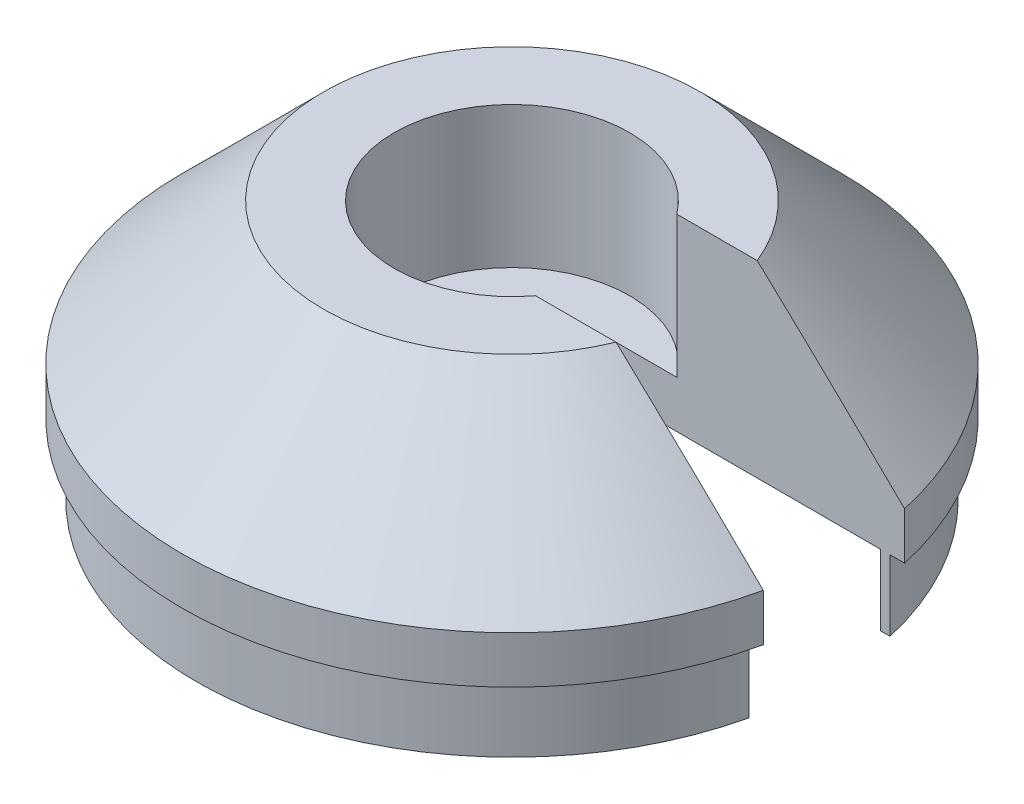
ISO-10303-21;
HEADER;
FILE_DESCRIPTION(('STEP AP214'),'2;1');
FILE_NAME('part.step','',(''),(''),'','','');
FILE_SCHEMA(('AUTOMOTIVE_DESIGN { 1 0 10303 214 1 1 1 1 }'));
ENDSEC;
DATA;
#1=APPLICATION_CONTEXT('core data for automotive mechanical design processes');
#2=APPLICATION_PROTOCOL_DEFINITION('international standard','automotive_design',2000,#1);
#3=PRODUCT_CONTEXT('',#1,'mechanical');
#4=PRODUCT('Part','Part','',(#3));
#5=PRODUCT_RELATED_PRODUCT_CATEGORY('part','',(#4));
#6=PRODUCT_DEFINITION_FORMATION('','',#4);
#7=PRODUCT_DEFINITION_CONTEXT('part definition',#1,'design');
#8=PRODUCT_DEFINITION('design','',#6,#7);
#9=PRODUCT_DEFINITION_SHAPE('','',#8);
#10=(LENGTH_UNIT() NAMED_UNIT(*) SI_UNIT(.MILLI.,.METRE.));
#11=(NAMED_UNIT(*) PLANE_ANGLE_UNIT() SI_UNIT($,.RADIAN.));
#12=(NAMED_UNIT(*) SI_UNIT($,.STERADIAN.) SOLID_ANGLE_UNIT());
#13=UNCERTAINTY_MEASURE_WITH_UNIT(LENGTH_MEASURE(1.E-05),#10,'distance_accuracy_value','');
#14=(GEOMETRIC_REPRESENTATION_CONTEXT(3) GLOBAL_UNCERTAINTY_ASSIGNED_CONTEXT((#13)) GLOBAL_UNIT_ASSIGNED_CONTEXT((#10,
#11,#12)) REPRESENTATION_CONTEXT('',''));
#15=CARTESIAN_POINT('',(0.,0.,0.));
#16=DIRECTION('',(0.,0.,1.));
#17=DIRECTION('',(1.,0.,0.));
#18=AXIS2_PLACEMENT_3D('',#15,#16,#17);
#19=CARTESIAN_POINT('',(6.5,0.,0.));
#20=DIRECTION('',(0.,-1.,0.));
#21=DIRECTION('',(0.,0.,-1.));
#22=AXIS2_PLACEMENT_3D('',#19,#20,#21);
#23=PLANE('',#22);
#24=CARTESIAN_POINT('',(0.,0.,0.));
#25=DIRECTION('',(0.,-1.,0.));
#26=DIRECTION('',(0.,0.,-1.));
#27=AXIS2_PLACEMENT_3D('',#24,#25,#26);
#28=CIRCLE('',#27,1.5);
#29=CARTESIAN_POINT('',(0.,0.,1.5));
#30=VERTEX_POINT('',#29);
#31=CARTESIAN_POINT('',(0.,0.,-1.5));
#32=VERTEX_POINT('',#31);
#33=EDGE_CURVE('E158',#30,#32,#28,.T.);
#34=ORIENTED_EDGE('',*,*,#33,.F.);
#35=DIRECTION('',(1.,0.,0.));
#36=VECTOR('',#35,1.);
#37=CARTESIAN_POINT('',(6.5,0.,1.5));
#38=LINE('',#37,#36);
#39=CARTESIAN_POINT('',(6.32455532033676,0.,1.5));
#40=VERTEX_POINT('',#39);
#41=EDGE_CURVE('E167',#30,#40,#38,.T.);
#42=ORIENTED_EDGE('',*,*,#41,.T.);
#43=CARTESIAN_POINT('',(0.,0.,0.));
#44=DIRECTION('',(0.,-1.,0.));
#45=DIRECTION('',(0.,0.,-1.));
#46=AXIS2_PLACEMENT_3D('',#43,#44,#45);
#47=CIRCLE('',#46,6.5);
#48=CARTESIAN_POINT('',(6.32455532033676,0.,-1.5));
#49=VERTEX_POINT('',#48);
#50=EDGE_CURVE('E137',#40,#49,#47,.T.);
#51=ORIENTED_EDGE('',*,*,#50,.T.);
#52=DIRECTION('',(-1.,0.,0.));
#53=VECTOR('',#52,1.);
#54=CARTESIAN_POINT('',(6.5,0.,-1.5));
#55=LINE('',#54,#53);
#56=EDGE_CURVE('E46',#49,#32,#55,.T.);
#57=ORIENTED_EDGE('',*,*,#56,.T.);
#58=EDGE_LOOP('',(#34,#42,#51,#57));
#59=FACE_BOUND('',#58,.T.);
#60=ADVANCED_FACE('F32',(#59),#23,.T.);
#61=CARTESIAN_POINT('',(0.,0.,0.));
#62=DIRECTION('',(0.,-1.,0.));
#63=DIRECTION('',(0.,0.,-1.));
#64=AXIS2_PLACEMENT_3D('',#61,#62,#63);
#65=CYLINDRICAL_SURFACE('',#64,1.5);
#66=CARTESIAN_POINT('',(0.,0.999999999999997,0.));
#67=DIRECTION('',(0.,-1.,0.));
#68=DIRECTION('',(0.,0.,-1.));
#69=AXIS2_PLACEMENT_3D('',#66,#67,#68);
#70=CIRCLE('',#69,1.5);
#71=CARTESIAN_POINT('',(0.,0.999999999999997,1.5));
#72=VERTEX_POINT('',#71);
#73=CARTESIAN_POINT('',(0.,0.999999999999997,-1.5));
#74=VERTEX_POINT('',#73);
#75=EDGE_CURVE('E155',#72,#74,#70,.T.);
#76=ORIENTED_EDGE('',*,*,#75,.F.);
#77=DIRECTION('',(0.,-1.,0.));
#78=VECTOR('',#77,1.);
#79=CARTESIAN_POINT('',(0.,4.,1.5));
#80=LINE('',#79,#78);
#81=EDGE_CURVE('E264',#72,#30,#80,.T.);
#82=ORIENTED_EDGE('',*,*,#81,.T.);
#83=ORIENTED_EDGE('',*,*,#33,.T.);
#84=DIRECTION('',(0.,-1.,0.));
#85=VECTOR('',#84,1.);
#86=CARTESIAN_POINT('',(0.,4.,-1.5));
#87=LINE('',#86,#85);
#88=EDGE_CURVE('E267',#74,#32,#87,.T.);
#89=ORIENTED_EDGE('',*,*,#88,.F.);
#90=EDGE_LOOP('',(#76,#82,#83,#89));
#91=FACE_BOUND('',#90,.T.);
#92=ADVANCED_FACE('F214',(#91),#65,.F.);
#93=CARTESIAN_POINT('',(1.5,0.999999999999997,0.));
#94=DIRECTION('',(0.,1.,0.));
#95=DIRECTION('',(0.,0.,1.));
#96=AXIS2_PLACEMENT_3D('',#93,#94,#95);
#97=PLANE('',#96);
#98=CARTESIAN_POINT('',(0.,0.999999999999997,0.));
#99=DIRECTION('',(0.,-1.,0.));
#100=DIRECTION('',(0.,0.,-1.));
#101=AXIS2_PLACEMENT_3D('',#98,#99,#100);
#102=CIRCLE('',#101,2.5);
#103=CARTESIAN_POINT('',(2.,0.999999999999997,1.5));
#104=VERTEX_POINT('',#103);
#105=CARTESIAN_POINT('',(2.,0.999999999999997,-1.5));
#106=VERTEX_POINT('',#105);
#107=EDGE_CURVE('E152',#104,#106,#102,.T.);
#108=ORIENTED_EDGE('',*,*,#107,.F.);
#109=DIRECTION('',(-1.,0.,0.));
#110=VECTOR('',#109,1.);
#111=CARTESIAN_POINT('',(1.5,0.999999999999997,1.5));
#112=LINE('',#111,#110);
#113=EDGE_CURVE('E168',#104,#72,#112,.T.);
#114=ORIENTED_EDGE('',*,*,#113,.T.);
#115=ORIENTED_EDGE('',*,*,#75,.T.);
#116=DIRECTION('',(1.,0.,0.));
#117=VECTOR('',#116,1.);
#118=CARTESIAN_POINT('',(1.5,0.999999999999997,-1.5));
#119=LINE('',#118,#117);
#120=EDGE_CURVE('E250',#74,#106,#119,.T.);
#121=ORIENTED_EDGE('',*,*,#120,.T.);
#122=EDGE_LOOP('',(#108,#114,#115,#121));
#123=FACE_BOUND('',#122,.T.);
#124=ADVANCED_FACE('F218',(#123),#97,.T.);
#125=CARTESIAN_POINT('',(0.,0.,0.));
#126=DIRECTION('',(0.,-1.,0.));
#127=DIRECTION('',(0.,0.,-1.));
#128=AXIS2_PLACEMENT_3D('',#125,#126,#127);
#129=CYLINDRICAL_SURFACE('',#128,2.5);
#130=CARTESIAN_POINT('',(0.,4.,0.));
#131=DIRECTION('',(0.,-1.,0.));
#132=DIRECTION('',(0.,0.,-1.));
#133=AXIS2_PLACEMENT_3D('',#130,#131,#132);
#134=CIRCLE('',#133,2.5);
#135=CARTESIAN_POINT('',(2.,4.,1.5));
#136=VERTEX_POINT('',#135);
#137=CARTESIAN_POINT('',(2.,4.,-1.5));
#138=VERTEX_POINT('',#137);
#139=EDGE_CURVE('E149',#136,#138,#134,.T.);
#140=ORIENTED_EDGE('',*,*,#139,.F.);
#141=DIRECTION('',(0.,-1.,0.));
#142=VECTOR('',#141,1.);
#143=CARTESIAN_POINT('',(2.,0.,1.5));
#144=LINE('',#143,#142);
#145=EDGE_CURVE('E170',#136,#104,#144,.T.);
#146=ORIENTED_EDGE('',*,*,#145,.T.);
#147=ORIENTED_EDGE('',*,*,#107,.T.);
#148=DIRECTION('',(0.,-1.,0.));
#149=VECTOR('',#148,1.);
#150=CARTESIAN_POINT('',(2.,0.,-1.5));
#151=LINE('',#150,#149);
#152=EDGE_CURVE('E253',#106,#138,#151,.F.);
#153=ORIENTED_EDGE('',*,*,#152,.T.);
#154=EDGE_LOOP('',(#140,#146,#147,#153));
#155=FACE_BOUND('',#154,.T.);
#156=ADVANCED_FACE('F223',(#155),#129,.F.);
#157=CARTESIAN_POINT('',(2.5,4.,0.));
#158=DIRECTION('',(0.,1.,0.));
#159=DIRECTION('',(0.,0.,1.));
#160=AXIS2_PLACEMENT_3D('',#157,#158,#159);
#161=PLANE('',#160);
#162=CARTESIAN_POINT('',(0.,4.,0.));
#163=DIRECTION('',(0.,-1.,0.));
#164=DIRECTION('',(0.,0.,-1.));
#165=AXIS2_PLACEMENT_3D('',#162,#163,#164);
#166=CIRCLE('',#165,4.);
#167=CARTESIAN_POINT('',(3.70809924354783,4.,1.5));
#168=VERTEX_POINT('',#167);
#169=CARTESIAN_POINT('',(3.70809924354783,4.,-1.5));
#170=VERTEX_POINT('',#169);
#171=EDGE_CURVE('E146',#168,#170,#166,.T.);
#172=ORIENTED_EDGE('',*,*,#171,.F.);
#173=DIRECTION('',(1.,0.,0.));
#174=VECTOR('',#173,1.);
#175=CARTESIAN_POINT('',(7.64260535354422,4.,1.5));
#176=LINE('',#175,#174);
#177=EDGE_CURVE('E120',#136,#168,#176,.T.);
#178=ORIENTED_EDGE('',*,*,#177,.F.);
#179=ORIENTED_EDGE('',*,*,#139,.T.);
#180=DIRECTION('',(-1.,0.,0.));
#181=VECTOR('',#180,1.);
#182=CARTESIAN_POINT('',(0.,4.,-1.5));
#183=LINE('',#182,#181);
#184=EDGE_CURVE('E238',#170,#138,#183,.T.);
#185=ORIENTED_EDGE('',*,*,#184,.F.);
#186=EDGE_LOOP('',(#172,#178,#179,#185));
#187=FACE_BOUND('',#186,.T.);
#188=ADVANCED_FACE('F210',(#187),#161,.T.);
#189=CARTESIAN_POINT('',(0.,1.,0.));
#190=DIRECTION('',(0.,-1.,0.));
#191=DIRECTION('',(0.,0.,-1.));
#192=AXIS2_PLACEMENT_3D('',#189,#190,#191);
#193=CONICAL_SURFACE('',#192,7.,0.785398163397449);
#194=CARTESIAN_POINT('',(0.,1.,0.));
#195=DIRECTION('',(0.,-1.,0.));
#196=DIRECTION('',(0.,0.,-1.));
#197=AXIS2_PLACEMENT_3D('',#194,#195,#196);
#198=CIRCLE('',#197,7.);
#199=CARTESIAN_POINT('',(6.83739716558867,1.,1.5));
#200=VERTEX_POINT('',#199);
#201=CARTESIAN_POINT('',(6.83739716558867,1.,-1.5));
#202=VERTEX_POINT('',#201);
#203=EDGE_CURVE('E143',#200,#202,#198,.T.);
#204=ORIENTED_EDGE('',*,*,#203,.F.);
#205=CARTESIAN_POINT('',(11.4720147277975,-3.56966386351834,1.5));
#206=CARTESIAN_POINT('',(11.125100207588,-3.22569209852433,1.5));
#207=CARTESIAN_POINT('',(10.7780683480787,-2.88183841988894,1.5));
#208=CARTESIAN_POINT('',(10.0835421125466,-2.19437544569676,1.5));
#209=CARTESIAN_POINT('',(9.73604762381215,-1.85076626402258,1.5));
#210=CARTESIAN_POINT('',(9.03839812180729,-1.16185620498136,1.5));
#211=CARTESIAN_POINT('',(8.68824014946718,-0.816558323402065,1.5));
#212=CARTESIAN_POINT('',(7.9873645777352,-0.126752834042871,1.5));
#213=CARTESIAN_POINT('',(7.63664719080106,0.217754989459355,1.5));
#214=CARTESIAN_POINT('',(7.05629368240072,0.786182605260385,1.5));
#215=CARTESIAN_POINT('',(6.82694398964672,1.01039475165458,1.5));
#216=CARTESIAN_POINT('',(6.3676678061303,1.45824240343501,1.5));
#217=CARTESIAN_POINT('',(6.13774129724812,1.68187789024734,1.5));
#218=CARTESIAN_POINT('',(5.67686082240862,2.12858466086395,1.5));
#219=CARTESIAN_POINT('',(5.44590601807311,2.35165508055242,1.5));
#220=CARTESIAN_POINT('',(4.98290791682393,2.7966095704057,1.5));
#221=CARTESIAN_POINT('',(4.75086475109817,3.01849377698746,1.5));
#222=CARTESIAN_POINT('',(4.28624308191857,3.45946240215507,1.5));
#223=CARTESIAN_POINT('',(4.05367251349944,3.67855515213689,1.5));
#224=CARTESIAN_POINT('',(3.70279881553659,4.00513812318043,1.5));
#225=CARTESIAN_POINT('',(3.58547683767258,4.11368165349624,1.5));
#226=CARTESIAN_POINT('',(3.34997649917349,4.32983020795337,1.5));
#227=CARTESIAN_POINT('',(3.23179816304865,4.43743525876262,1.5));
#228=CARTESIAN_POINT('',(2.99453875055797,4.65117766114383,1.5));
#229=CARTESIAN_POINT('',(2.8754599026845,4.75731747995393,1.5));
#230=CARTESIAN_POINT('',(2.63576627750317,4.96784276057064,1.5));
#231=CARTESIAN_POINT('',(2.51515155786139,5.07222828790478,1.5));
#232=CARTESIAN_POINT('',(2.2718520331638,5.27839976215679,1.5));
#233=CARTESIAN_POINT('',(2.14916878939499,5.38018753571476,1.5));
#234=CARTESIAN_POINT('',(1.96280230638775,5.52993031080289,1.5));
#235=CARTESIAN_POINT('',(1.9002966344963,5.57934966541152,1.5));
#236=CARTESIAN_POINT('',(1.77431897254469,5.67693872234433,1.5));
#237=CARTESIAN_POINT('',(1.71084704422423,5.72510850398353,1.5));
#238=CARTESIAN_POINT('',(1.60820102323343,5.80099145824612,1.5));
#239=CARTESIAN_POINT('',(1.56940689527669,5.8292186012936,1.5));
#240=CARTESIAN_POINT('',(1.49132147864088,5.88498413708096,1.5));
#241=CARTESIAN_POINT('',(1.45203015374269,5.91252247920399,1.5));
#242=CARTESIAN_POINT('',(1.37286506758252,5.96679395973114,1.5));
#243=CARTESIAN_POINT('',(1.33299103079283,5.99352669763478,1.5));
#244=CARTESIAN_POINT('',(1.25260139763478,6.04600764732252,1.5));
#245=CARTESIAN_POINT('',(1.21208580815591,6.07175586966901,1.5));
#246=CARTESIAN_POINT('',(1.09012762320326,6.14682106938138,1.5));
#247=CARTESIAN_POINT('',(1.00761110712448,6.19442062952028,1.5));
#248=CARTESIAN_POINT('',(0.838995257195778,6.28280275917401,1.5));
#249=CARTESIAN_POINT('',(0.752899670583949,6.32359224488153,1.5));
#250=CARTESIAN_POINT('',(0.619511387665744,6.37762711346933,1.5));
#251=CARTESIAN_POINT('',(0.573738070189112,6.39461323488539,1.5));
#252=CARTESIAN_POINT('',(0.481106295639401,6.42534012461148,1.5));
#253=CARTESIAN_POINT('',(0.434247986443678,6.43908133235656,1.5));
#254=CARTESIAN_POINT('',(0.339813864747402,6.46266566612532,1.5));
#255=CARTESIAN_POINT('',(0.292243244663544,6.47252929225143,1.5));
#256=CARTESIAN_POINT('',(0.196410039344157,6.48793422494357,1.5));
#257=CARTESIAN_POINT('',(0.148147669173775,6.49347684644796,1.5));
#258=CARTESIAN_POINT('',(0.0508524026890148,6.49993025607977,1.5));
#259=CARTESIAN_POINT('',(0.00181652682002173,6.50079705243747,1.5));
#260=CARTESIAN_POINT('',(-0.0961005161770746,6.49772173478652,1.5));
#261=CARTESIAN_POINT('',(-0.144981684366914,6.49377965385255,1.5));
#262=CARTESIAN_POINT('',(-0.242360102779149,6.48131809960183,1.5));
#263=CARTESIAN_POINT('',(-0.290854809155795,6.47277907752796,1.5));
#264=CARTESIAN_POINT('',(-0.386936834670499,6.4516069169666,1.5));
#265=CARTESIAN_POINT('',(-0.434523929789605,6.4389727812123,1.5));
#266=CARTESIAN_POINT('',(-0.552592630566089,6.40288275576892,1.5));
#267=CARTESIAN_POINT('',(-0.622388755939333,6.37719264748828,1.5));
#268=CARTESIAN_POINT('',(-0.759471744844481,6.31984831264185,1.5));
#269=CARTESIAN_POINT('',(-0.826756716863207,6.28818969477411,1.5));
#270=CARTESIAN_POINT('',(-0.959749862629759,6.22016235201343,1.5));
#271=CARTESIAN_POINT('',(-1.02543473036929,6.18374857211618,1.5));
#272=CARTESIAN_POINT('',(-1.12248760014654,6.12668808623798,1.5));
#273=CARTESIAN_POINT('',(-1.15458774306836,6.10726462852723,1.5));
#274=CARTESIAN_POINT('',(-1.21834730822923,6.06770978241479,1.5));
#275=CARTESIAN_POINT('',(-1.25000675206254,6.04757842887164,1.5));
#276=CARTESIAN_POINT('',(-1.36190710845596,5.97489841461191,1.5));
#277=CARTESIAN_POINT('',(-1.44105693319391,5.92066856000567,1.5));
#278=CARTESIAN_POINT('',(-1.59738232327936,5.80942358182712,1.5));
#279=CARTESIAN_POINT('',(-1.67455734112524,5.75240769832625,1.5));
#280=CARTESIAN_POINT('',(-1.82743189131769,5.63630955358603,1.5));
#281=CARTESIAN_POINT('',(-1.90313015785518,5.57722563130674,1.5));
#282=CARTESIAN_POINT('',(-2.05332260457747,5.4575434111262,1.5));
#283=CARTESIAN_POINT('',(-2.12781670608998,5.39694501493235,1.5));
#284=CARTESIAN_POINT('',(-2.35041660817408,5.21299442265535,1.5));
#285=CARTESIAN_POINT('',(-2.49709090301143,5.0879127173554,1.5));
#286=CARTESIAN_POINT('',(-2.78789466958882,4.83499320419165,1.5));
#287=CARTESIAN_POINT('',(-2.93202535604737,4.70715678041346,1.5));
#288=CARTESIAN_POINT('',(-3.20215970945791,4.46436081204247,1.5));
#289=CARTESIAN_POINT('',(-3.32834709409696,4.34960529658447,1.5));
#290=CARTESIAN_POINT('',(-3.57975353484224,4.11900344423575,1.5));
#291=CARTESIAN_POINT('',(-3.704972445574,4.00315694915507,1.5));
#292=CARTESIAN_POINT('',(-3.95376926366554,3.77149658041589,1.5));
#293=CARTESIAN_POINT('',(-4.07735250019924,3.65568842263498,1.5));
#294=CARTESIAN_POINT('',(-4.32391606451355,3.42347565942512,1.5));
#295=CARTESIAN_POINT('',(-4.44689649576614,3.30707116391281,1.5));
#296=CARTESIAN_POINT('',(-4.56966386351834,3.19044411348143,1.5));
#297=B_SPLINE_CURVE_WITH_KNOTS('',3,(#205,#206,#207,#208,#209,#210,#211,#212,#213,#214,#215,
#216,#217,#218,#219,#220,#221,#222,#223,#224,#225,#226,#227,#228,#229,#230,#231,#232,#233,#234,
#235,#236,#237,#238,#239,#240,#241,#242,#243,#244,#245,#246,#247,#248,#249,#250,#251,#252,#253,
#254,#255,#256,#257,#258,#259,#260,#261,#262,#263,#264,#265,#266,#267,#268,#269,#270,#271,#272,
#273,#274,#275,#276,#277,#278,#279,#280,#281,#282,#283,#284,#285,#286,#287,#288,#289,#290,#291,
#292,#293,#294,#295,#296),.UNSPECIFIED.,.F.,.F.,(4,2,2,2,2,2,2,2,2,2,2,2,2,2,2,2,2,2,2,2,2,2,2,
2,2,2,2,2,2,2,2,2,2,2,2,2,2,2,2,2,2,2,2,2,2,4),(0.,1.46560467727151,2.93167982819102,
4.40699992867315,5.88185260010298,6.84406352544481,7.80630506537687,8.76958024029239,
9.73274214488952,10.6912742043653,11.1707653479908,11.6502428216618,12.1287787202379,
12.6072967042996,13.0854683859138,13.3245034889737,13.5635233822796,13.7074471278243,
13.8513814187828,13.9953861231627,14.1393892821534,14.4249756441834,14.7102701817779,
14.8566441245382,15.0029982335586,15.1485678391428,15.2940931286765,15.4409852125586,
15.5878762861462,15.7353970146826,15.8829536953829,16.1056737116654,16.3285582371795,
16.5537329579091,16.6662838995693,16.7788293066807,17.0665675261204,17.3543846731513,
17.6424385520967,17.9305111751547,18.5087400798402,19.0866849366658,19.5983683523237,
20.1101271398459,20.6182184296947,21.126219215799),.UNSPECIFIED.);
#298=EDGE_CURVE('E175',#200,#168,#297,.T.);
#299=ORIENTED_EDGE('',*,*,#298,.T.);
#300=ORIENTED_EDGE('',*,*,#171,.T.);
#301=CARTESIAN_POINT('',(-4.56966386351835,3.19044411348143,-1.5));
#302=CARTESIAN_POINT('',(-4.41360388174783,3.3386704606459,-1.5));
#303=CARTESIAN_POINT('',(-4.25721928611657,3.4865602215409,-1.5));
#304=CARTESIAN_POINT('',(-3.9433641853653,3.78133985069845,-1.5));
#305=CARTESIAN_POINT('',(-3.78589317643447,3.92822918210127,-1.5));
#306=CARTESIAN_POINT('',(-3.46733380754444,4.22261153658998,-1.5));
#307=CARTESIAN_POINT('',(-3.30622585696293,4.37008341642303,-1.5));
#308=CARTESIAN_POINT('',(-2.98202164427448,4.6627036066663,-1.5));
#309=CARTESIAN_POINT('',(-2.81892619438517,4.80785281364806,-1.5));
#310=CARTESIAN_POINT('',(-2.51991760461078,5.06817474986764,-1.5));
#311=CARTESIAN_POINT('',(-2.38452902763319,5.18394587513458,-1.5));
#312=CARTESIAN_POINT('',(-2.1790331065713,5.35486192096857,-1.5));
#313=CARTESIAN_POINT('',(-2.11009283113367,5.41140819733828,-1.5));
#314=CARTESIAN_POINT('',(-1.97123929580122,5.52329102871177,-1.5));
#315=CARTESIAN_POINT('',(-1.90132607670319,5.57862763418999,-1.5));
#316=CARTESIAN_POINT('',(-1.76043893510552,5.68760821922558,-1.5));
#317=CARTESIAN_POINT('',(-1.68946774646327,5.74125572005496,-1.5));
#318=CARTESIAN_POINT('',(-1.54599872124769,5.84646105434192,-1.5));
#319=CARTESIAN_POINT('',(-1.47350109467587,5.89801917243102,-1.5));
#320=CARTESIAN_POINT('',(-1.32666892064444,5.99820791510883,-1.5));
#321=CARTESIAN_POINT('',(-1.25233752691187,6.04684313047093,-1.5));
#322=CARTESIAN_POINT('',(-1.10122640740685,6.1401182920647,-1.5));
#323=CARTESIAN_POINT('',(-1.02444806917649,6.18476044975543,-1.5));
#324=CARTESIAN_POINT('',(-0.887951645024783,6.25757503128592,-1.5));
#325=CARTESIAN_POINT('',(-0.828923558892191,6.28703063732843,-1.5));
#326=CARTESIAN_POINT('',(-0.708918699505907,6.34177390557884,-1.5));
#327=CARTESIAN_POINT('',(-0.647941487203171,6.36706062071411,-1.5));
#328=CARTESIAN_POINT('',(-0.524478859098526,6.41198157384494,-1.5));
#329=CARTESIAN_POINT('',(-0.462010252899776,6.43166117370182,-1.5));
#330=CARTESIAN_POINT('',(-0.335317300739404,6.46419140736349,-1.5));
#331=CARTESIAN_POINT('',(-0.271094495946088,6.47704784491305,-1.5));
#332=CARTESIAN_POINT('',(-0.159969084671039,6.49219520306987,-1.5));
#333=CARTESIAN_POINT('',(-0.113331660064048,6.49645048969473,-1.5));
#334=CARTESIAN_POINT('',(-0.0198640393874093,6.50059411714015,-1.5));
#335=CARTESIAN_POINT('',(0.0269661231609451,6.50048318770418,-1.5));
#336=CARTESIAN_POINT('',(0.12046263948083,6.49589645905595,-1.5));
#337=CARTESIAN_POINT('',(0.167128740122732,6.4914155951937,-1.5));
#338=CARTESIAN_POINT('',(0.259881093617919,6.47834721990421,-1.5));
#339=CARTESIAN_POINT('',(0.305967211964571,6.46975877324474,-1.5));
#340=CARTESIAN_POINT('',(0.414504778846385,6.44498596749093,-1.5));
#341=CARTESIAN_POINT('',(0.476580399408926,6.42715889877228,-1.5));
#342=CARTESIAN_POINT('',(0.598835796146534,6.38591154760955,-1.5));
#343=CARTESIAN_POINT('',(0.659014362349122,6.36248777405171,-1.5));
#344=CARTESIAN_POINT('',(0.777838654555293,6.3111709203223,-1.5));
#345=CARTESIAN_POINT('',(0.836472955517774,6.28325175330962,-1.5));
#346=CARTESIAN_POINT('',(0.951998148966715,6.22409468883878,-1.5));
#347=CARTESIAN_POINT('',(1.00888959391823,6.1928578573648,-1.5));
#348=CARTESIAN_POINT('',(1.1220701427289,6.12733387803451,-1.5));
#349=CARTESIAN_POINT('',(1.17833582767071,6.0930065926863,-1.5));
#350=CARTESIAN_POINT('',(1.28958530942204,6.0223267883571,-1.5));
#351=CARTESIAN_POINT('',(1.34456887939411,5.98597391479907,-1.5));
#352=CARTESIAN_POINT('',(1.50799769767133,5.87452099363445,-1.5));
#353=CARTESIAN_POINT('',(1.61483952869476,5.79707564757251,-1.5));
#354=CARTESIAN_POINT('',(1.82578852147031,5.63806712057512,-1.5));
#355=CARTESIAN_POINT('',(1.92988808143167,5.5564940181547,-1.5));
#356=CARTESIAN_POINT('',(2.13595226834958,5.39067927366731,-1.5));
#357=CARTESIAN_POINT('',(2.23791663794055,5.30643731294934,-1.5));
#358=CARTESIAN_POINT('',(2.44094442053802,5.13552879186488,-1.5));
#359=CARTESIAN_POINT('',(2.54199735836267,5.04884984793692,-1.5));
#360=CARTESIAN_POINT('',(2.74292006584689,4.87411533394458,-1.5));
#361=CARTESIAN_POINT('',(2.84278972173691,4.78605963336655,-1.5));
#362=CARTESIAN_POINT('',(3.04143584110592,4.60908529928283,-1.5));
#363=CARTESIAN_POINT('',(3.14021395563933,4.52016851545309,-1.5));
#364=CARTESIAN_POINT('',(3.33705434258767,4.34155405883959,-1.5));
#365=CARTESIAN_POINT('',(3.43511663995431,4.25185641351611,-1.5));
#366=CARTESIAN_POINT('',(3.70660652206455,4.00196348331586,-1.5));
#367=CARTESIAN_POINT('',(3.87942822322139,3.84111030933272,-1.5));
#368=CARTESIAN_POINT('',(4.22385355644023,3.51810410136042,-1.5));
#369=CARTESIAN_POINT('',(4.39545717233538,3.35595105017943,-1.5));
#370=CARTESIAN_POINT('',(4.73779301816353,3.03071138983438,-1.5));
#371=CARTESIAN_POINT('',(4.908525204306,2.86762473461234,-1.5));
#372=CARTESIAN_POINT('',(5.24933518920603,2.54076878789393,-1.5));
#373=CARTESIAN_POINT('',(5.41941298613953,2.37699949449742,-1.5));
#374=CARTESIAN_POINT('',(5.92922385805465,1.88462160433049,-1.5));
#375=CARTESIAN_POINT('',(6.26821636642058,1.55524649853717,-1.5));
#376=CARTESIAN_POINT('',(6.94498171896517,0.895266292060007,-1.5));
#377=CARTESIAN_POINT('',(7.28275459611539,0.564661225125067,-1.5));
#378=CARTESIAN_POINT('',(7.94228870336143,-0.0824553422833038,-1.5));
#379=CARTESIAN_POINT('',(8.26408553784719,-0.398930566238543,-1.5));
#380=CARTESIAN_POINT('',(8.90716120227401,-1.03241231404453,-1.5));
#381=CARTESIAN_POINT('',(9.2284400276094,-1.34941884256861,-1.5));
#382=CARTESIAN_POINT('',(9.87026570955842,-1.98346922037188,-1.5));
#383=CARTESIAN_POINT('',(10.1908129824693,-2.30051264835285,-1.5));
#384=CARTESIAN_POINT('',(10.8316124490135,-2.93489106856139,-1.5));
#385=CARTESIAN_POINT('',(11.1518646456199,-3.25222605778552,-1.5));
#386=CARTESIAN_POINT('',(11.4720147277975,-3.56966386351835,-1.5));
#387=B_SPLINE_CURVE_WITH_KNOTS('',3,(#301,#302,#303,#304,#305,#306,#307,#308,#309,#310,#311,
#312,#313,#314,#315,#316,#317,#318,#319,#320,#321,#322,#323,#324,#325,#326,#327,#328,#329,#330,
#331,#332,#333,#334,#335,#336,#337,#338,#339,#340,#341,#342,#343,#344,#345,#346,#347,#348,#349,
#350,#351,#352,#353,#354,#355,#356,#357,#358,#359,#360,#361,#362,#363,#364,#365,#366,#367,#368,
#369,#370,#371,#372,#373,#374,#375,#376,#377,#378,#379,#380,#381,#382,#383,#384,#385,#386),
.UNSPECIFIED.,.F.,.F.,(4,2,2,2,2,2,2,2,2,2,2,2,2,2,2,2,2,2,2,2,2,2,2,2,2,2,2,2,2,2,2,2,2,2,2,2,
2,2,2,2,2,2,4),(0.,0.645707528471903,1.29173787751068,1.94695938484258,2.60192155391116,
3.13628400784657,3.40376632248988,3.67123745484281,3.93810807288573,4.20494221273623,
4.47134567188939,4.73760066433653,4.9353883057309,5.1332208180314,5.32940420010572,
5.52542044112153,5.66572550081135,5.80600711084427,5.94645149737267,6.08692787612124,
6.28032855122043,6.47385018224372,6.668538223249,6.86316389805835,7.06084022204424,
7.25855125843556,7.65425818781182,8.05096615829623,8.44772167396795,8.84711116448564,
9.2465387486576,9.64524360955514,10.0439345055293,10.7522096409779,11.4604941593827,
12.1688139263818,12.8771356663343,14.2950979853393,15.713021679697,17.0670473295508,
18.42108495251,19.7736392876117,21.1261798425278),.UNSPECIFIED.);
#388=EDGE_CURVE('E241',#170,#202,#387,.T.);
#389=ORIENTED_EDGE('',*,*,#388,.T.);
#390=EDGE_LOOP('',(#204,#299,#300,#389));
#391=FACE_BOUND('',#390,.T.);
#392=ADVANCED_FACE('F185',(#391),#193,.T.);
#393=CARTESIAN_POINT('',(0.,0.,0.));
#394=DIRECTION('',(0.,-1.,0.));
#395=DIRECTION('',(0.,0.,-1.));
#396=AXIS2_PLACEMENT_3D('',#393,#394,#395);
#397=CYLINDRICAL_SURFACE('',#396,7.);
#398=CARTESIAN_POINT('',(0.,0.,0.));
#399=DIRECTION('',(0.,-1.,0.));
#400=DIRECTION('',(0.,0.,-1.));
#401=AXIS2_PLACEMENT_3D('',#398,#399,#400);
#402=CIRCLE('',#401,7.);
#403=CARTESIAN_POINT('',(6.83739716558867,0.,1.5));
#404=VERTEX_POINT('',#403);
#405=CARTESIAN_POINT('',(6.83739716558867,0.,-1.5));
#406=VERTEX_POINT('',#405);
#407=EDGE_CURVE('E135',#404,#406,#402,.T.);
#408=ORIENTED_EDGE('',*,*,#407,.F.);
#409=DIRECTION('',(0.,-1.,0.));
#410=VECTOR('',#409,1.);
#411=CARTESIAN_POINT('',(6.83739716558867,0.,1.5));
#412=LINE('',#411,#410);
#413=EDGE_CURVE('E183',#404,#200,#412,.F.);
#414=ORIENTED_EDGE('',*,*,#413,.T.);
#415=ORIENTED_EDGE('',*,*,#203,.T.);
#416=DIRECTION('',(0.,-1.,0.));
#417=VECTOR('',#416,1.);
#418=CARTESIAN_POINT('',(6.83739716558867,0.,-1.5));
#419=LINE('',#418,#417);
#420=EDGE_CURVE('E260',#202,#406,#419,.T.);
#421=ORIENTED_EDGE('',*,*,#420,.T.);
#422=EDGE_LOOP('',(#408,#414,#415,#421));
#423=FACE_BOUND('',#422,.T.);
#424=ADVANCED_FACE('F203',(#423),#397,.T.);
#425=CARTESIAN_POINT('',(7.,0.,0.));
#426=DIRECTION('',(0.,-1.,0.));
#427=DIRECTION('',(0.,0.,-1.));
#428=AXIS2_PLACEMENT_3D('',#425,#426,#427);
#429=PLANE('',#428);
#430=CARTESIAN_POINT('',(0.,0.,0.));
#431=DIRECTION('',(0.,-1.,0.));
#432=DIRECTION('',(0.,0.,-1.));
#433=AXIS2_PLACEMENT_3D('',#430,#431,#432);
#434=CIRCLE('',#433,6.7);
#435=CARTESIAN_POINT('',(6.5299310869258,0.,1.5));
#436=VERTEX_POINT('',#435);
#437=CARTESIAN_POINT('',(6.5299310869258,0.,-1.5));
#438=VERTEX_POINT('',#437);
#439=EDGE_CURVE('E129',#436,#438,#434,.T.);
#440=ORIENTED_EDGE('',*,*,#439,.F.);
#441=DIRECTION('',(1.,0.,0.));
#442=VECTOR('',#441,1.);
#443=CARTESIAN_POINT('',(7.,0.,1.5));
#444=LINE('',#443,#442);
#445=EDGE_CURVE('E245',#436,#404,#444,.T.);
#446=ORIENTED_EDGE('',*,*,#445,.T.);
#447=ORIENTED_EDGE('',*,*,#407,.T.);
#448=DIRECTION('',(-1.,0.,0.));
#449=VECTOR('',#448,1.);
#450=CARTESIAN_POINT('',(7.,0.,-1.5));
#451=LINE('',#450,#449);
#452=EDGE_CURVE('E130',#406,#438,#451,.T.);
#453=ORIENTED_EDGE('',*,*,#452,.T.);
#454=EDGE_LOOP('',(#440,#446,#447,#453));
#455=FACE_BOUND('',#454,.T.);
#456=ADVANCED_FACE('F201',(#455),#429,.T.);
#457=CARTESIAN_POINT('',(0.,0.,0.));
#458=DIRECTION('',(0.,-1.,0.));
#459=DIRECTION('',(0.,0.,-1.));
#460=AXIS2_PLACEMENT_3D('',#457,#458,#459);
#461=CYLINDRICAL_SURFACE('',#460,6.7);
#462=CARTESIAN_POINT('',(0.,-1.5,0.));
#463=DIRECTION('',(0.,-1.,0.));
#464=DIRECTION('',(0.,0.,-1.));
#465=AXIS2_PLACEMENT_3D('',#462,#463,#464);
#466=CIRCLE('',#465,6.7);
#467=CARTESIAN_POINT('',(6.5299310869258,-1.5,1.5));
#468=VERTEX_POINT('',#467);
#469=CARTESIAN_POINT('',(6.5299310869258,-1.5,-1.5));
#470=VERTEX_POINT('',#469);
#471=EDGE_CURVE('E127',#468,#470,#466,.T.);
#472=ORIENTED_EDGE('',*,*,#471,.F.);
#473=DIRECTION('',(0.,-1.,0.));
#474=VECTOR('',#473,1.);
#475=CARTESIAN_POINT('',(6.5299310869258,0.,1.5));
#476=LINE('',#475,#474);
#477=EDGE_CURVE('E246',#468,#436,#476,.F.);
#478=ORIENTED_EDGE('',*,*,#477,.T.);
#479=ORIENTED_EDGE('',*,*,#439,.T.);
#480=DIRECTION('',(0.,-1.,0.));
#481=VECTOR('',#480,1.);
#482=CARTESIAN_POINT('',(6.5299310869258,0.,-1.5));
#483=LINE('',#482,#481);
#484=EDGE_CURVE('E114',#438,#470,#483,.T.);
#485=ORIENTED_EDGE('',*,*,#484,.T.);
#486=EDGE_LOOP('',(#472,#478,#479,#485));
#487=FACE_BOUND('',#486,.T.);
#488=ADVANCED_FACE('F125',(#487),#461,.T.);
#489=CARTESIAN_POINT('',(6.7,-1.5,0.));
#490=DIRECTION('',(0.,-1.,0.));
#491=DIRECTION('',(0.,0.,-1.));
#492=AXIS2_PLACEMENT_3D('',#489,#490,#491);
#493=PLANE('',#492);
#494=CARTESIAN_POINT('',(0.,-1.5,0.));
#495=DIRECTION('',(0.,-1.,0.));
#496=DIRECTION('',(0.,0.,-1.));
#497=AXIS2_PLACEMENT_3D('',#494,#495,#496);
#498=CIRCLE('',#497,6.5);
#499=CARTESIAN_POINT('',(6.32455532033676,-1.5,1.5));
#500=VERTEX_POINT('',#499);
#501=CARTESIAN_POINT('',(6.32455532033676,-1.5,-1.5));
#502=VERTEX_POINT('',#501);
#503=EDGE_CURVE('E133',#500,#502,#498,.T.);
#504=ORIENTED_EDGE('',*,*,#503,.F.);
#505=DIRECTION('',(1.,0.,0.));
#506=VECTOR('',#505,1.);
#507=CARTESIAN_POINT('',(7.64260535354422,-1.5,1.5));
#508=LINE('',#507,#506);
#509=EDGE_CURVE('E54',#500,#468,#508,.T.);
#510=ORIENTED_EDGE('',*,*,#509,.T.);
#511=ORIENTED_EDGE('',*,*,#471,.T.);
#512=DIRECTION('',(-1.,0.,0.));
#513=VECTOR('',#512,1.);
#514=CARTESIAN_POINT('',(0.,-1.5,-1.5));
#515=LINE('',#514,#513);
#516=EDGE_CURVE('E111',#470,#502,#515,.T.);
#517=ORIENTED_EDGE('',*,*,#516,.T.);
#518=EDGE_LOOP('',(#504,#510,#511,#517));
#519=FACE_BOUND('',#518,.T.);
#520=ADVANCED_FACE('F132',(#519),#493,.T.);
#521=CARTESIAN_POINT('',(0.,0.,0.));
#522=DIRECTION('',(0.,-1.,0.));
#523=DIRECTION('',(0.,0.,-1.));
#524=AXIS2_PLACEMENT_3D('',#521,#522,#523);
#525=CYLINDRICAL_SURFACE('',#524,6.5);
#526=ORIENTED_EDGE('',*,*,#50,.F.);
#527=DIRECTION('',(0.,-1.,0.));
#528=VECTOR('',#527,1.);
#529=CARTESIAN_POINT('',(6.32455532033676,0.,1.5));
#530=LINE('',#529,#528);
#531=EDGE_CURVE('E11',#40,#500,#530,.T.);
#532=ORIENTED_EDGE('',*,*,#531,.T.);
#533=ORIENTED_EDGE('',*,*,#503,.T.);
#534=DIRECTION('',(0.,-1.,0.));
#535=VECTOR('',#534,1.);
#536=CARTESIAN_POINT('',(6.32455532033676,0.,-1.5));
#537=LINE('',#536,#535);
#538=EDGE_CURVE('E39',#502,#49,#537,.F.);
#539=ORIENTED_EDGE('',*,*,#538,.T.);
#540=EDGE_LOOP('',(#526,#532,#533,#539));
#541=FACE_BOUND('',#540,.T.);
#542=ADVANCED_FACE('F163',(#541),#525,.F.);
#543=CARTESIAN_POINT('',(0.,4.,-1.5));
#544=DIRECTION('',(0.,0.,1.));
#545=DIRECTION('',(1.,0.,0.));
#546=AXIS2_PLACEMENT_3D('',#543,#544,#545);
#547=PLANE('',#546);
#548=ORIENTED_EDGE('',*,*,#88,.T.);
#549=ORIENTED_EDGE('',*,*,#56,.F.);
#550=ORIENTED_EDGE('',*,*,#538,.F.);
#551=ORIENTED_EDGE('',*,*,#516,.F.);
#552=ORIENTED_EDGE('',*,*,#484,.F.);
#553=ORIENTED_EDGE('',*,*,#452,.F.);
#554=ORIENTED_EDGE('',*,*,#420,.F.);
#555=ORIENTED_EDGE('',*,*,#388,.F.);
#556=ORIENTED_EDGE('',*,*,#184,.T.);
#557=ORIENTED_EDGE('',*,*,#152,.F.);
#558=ORIENTED_EDGE('',*,*,#120,.F.);
#559=EDGE_LOOP('',(#548,#549,#550,#551,#552,#553,#554,#555,#556,#557,#558));
#560=FACE_BOUND('',#559,.T.);
#561=ADVANCED_FACE('F113',(#560),#547,.T.);
#562=CARTESIAN_POINT('',(7.64260535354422,4.,1.5));
#563=DIRECTION('',(0.,0.,-1.));
#564=DIRECTION('',(-1.,0.,0.));
#565=AXIS2_PLACEMENT_3D('',#562,#563,#564);
#566=PLANE('',#565);
#567=ORIENTED_EDGE('',*,*,#145,.F.);
#568=ORIENTED_EDGE('',*,*,#177,.T.);
#569=ORIENTED_EDGE('',*,*,#298,.F.);
#570=ORIENTED_EDGE('',*,*,#413,.F.);
#571=ORIENTED_EDGE('',*,*,#445,.F.);
#572=ORIENTED_EDGE('',*,*,#477,.F.);
#573=ORIENTED_EDGE('',*,*,#509,.F.);
#574=ORIENTED_EDGE('',*,*,#531,.F.);
#575=ORIENTED_EDGE('',*,*,#41,.F.);
#576=ORIENTED_EDGE('',*,*,#81,.F.);
#577=ORIENTED_EDGE('',*,*,#113,.F.);
#578=EDGE_LOOP('',(#567,#568,#569,#570,#571,#572,#573,#574,#575,#576,#577));
#579=FACE_BOUND('',#578,.T.);
#580=ADVANCED_FACE('F189',(#579),#566,.T.);
#581=CLOSED_SHELL('',(#60,#92,#124,#156,#188,#392,#424,#456,#488,#520,#542,#561,#580));
#582=MANIFOLD_SOLID_BREP('B2',#581);
#583=ADVANCED_BREP_SHAPE_REPRESENTATION('',(#18,#582),#14);
#584=SHAPE_DEFINITION_REPRESENTATION(#9,#583);
ENDSEC;
END-ISO-10303-21;
